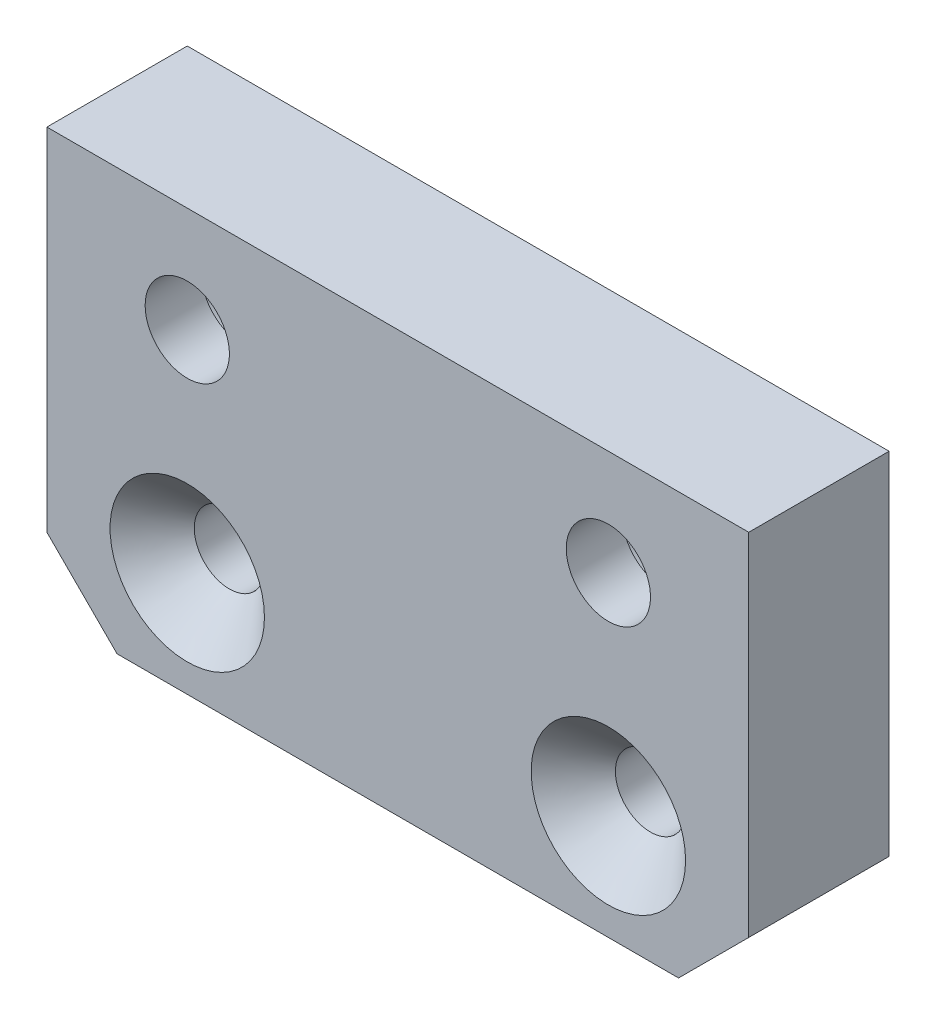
from build123d import *

# Parameters (mm, degrees)
ESQUISSE1_W          = 50
ESQUISSE1_H          = 30
BASE_EXTRUSION_DEPTH = 10
PER_AGE1_D           = 5
PER_AGE1_CSINK_D     = 11
PER_AGE1_CSINK_ANGLE = 90
PER_AGE2_D           = 6
PER_AGE2_CBORE_D     = 11
PER_AGE2_CBORE_DEPTH = 6
CHANFREIN1_SIZE      = 5


with BuildPart() as part:
    # Esquisse1 → Base-Extrusion (new body)
    with BuildSketch(Plane.XY):
        with Locations((0, 15)):
            Rectangle(ESQUISSE1_W, ESQUISSE1_H)
    extrude(amount=BASE_EXTRUSION_DEPTH)

    # Per_age1 (through all)
    with Locations(Plane.XY.offset(10)):
        with Locations((15, 7.5)):
            per_age1 = CounterSinkHole(PER_AGE1_D / 2, PER_AGE1_CSINK_D / 2, counter_sink_angle=PER_AGE1_CSINK_ANGLE)

    # Sym_trie1: Per_age1 across plane
    add(per_age1.mirror(Plane(origin=(0, 0, 0), x_dir=(0, 0, 1), z_dir=(1, 0, 0))), mode=Mode.SUBTRACT)

    # Per_age2 (through all)
    with Locations(Plane(origin=(0, 0, 0), x_dir=(-1, 0, 0), z_dir=(0, 0, -1))):
        with Locations((-15, 22.5)):
            per_age2 = CounterBoreHole(PER_AGE2_D / 2, PER_AGE2_CBORE_D / 2, PER_AGE2_CBORE_DEPTH)

    # Sym_trie2: Per_age2 across plane
    add(per_age2.mirror(Plane(origin=(0, 0, 0), x_dir=(0, 0, 1), z_dir=(1, 0, 0))), mode=Mode.SUBTRACT)

    # Chanfrein1
    chanfrein1_edges = [part.edges().sort_by_distance(p)[0] for p in [
        (-25, 0, 5),
        (25, 0, 5),
    ]]
    chamfer(chanfrein1_edges, length=CHANFREIN1_SIZE)


solid = part.part
